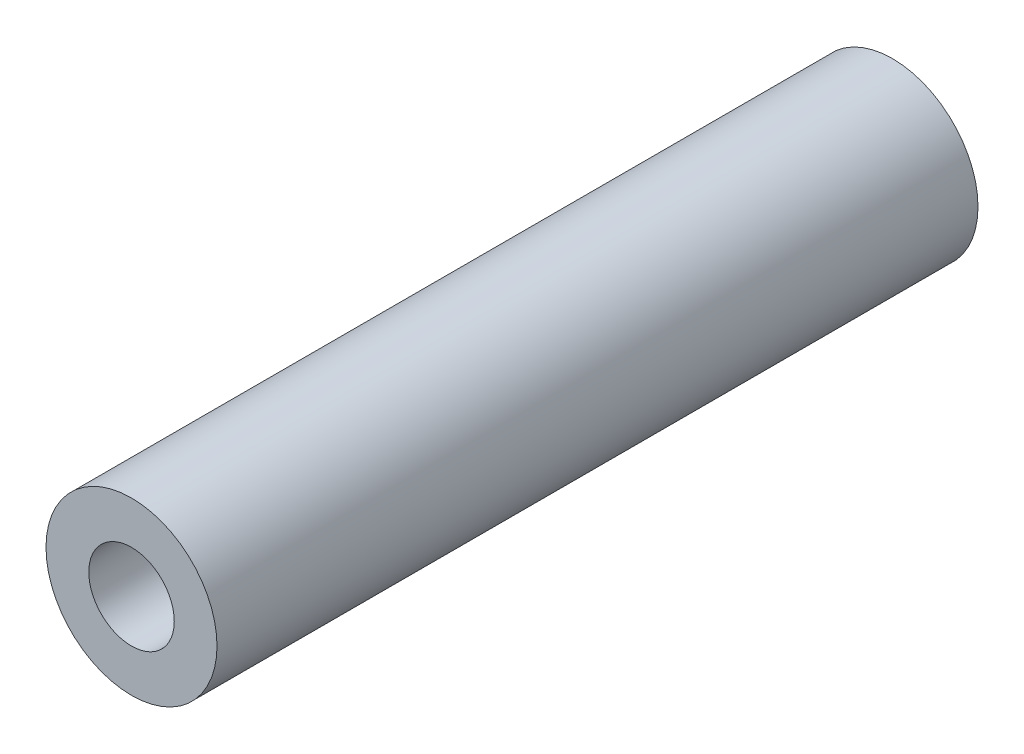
ISO-10303-21;
HEADER;
FILE_DESCRIPTION(('STEP AP214'),'2;1');
FILE_NAME('part.step','',(''),(''),'','','');
FILE_SCHEMA(('AUTOMOTIVE_DESIGN { 1 0 10303 214 1 1 1 1 }'));
ENDSEC;
DATA;
#1=APPLICATION_CONTEXT('core data for automotive mechanical design processes');
#2=APPLICATION_PROTOCOL_DEFINITION('international standard','automotive_design',2000,#1);
#3=PRODUCT_CONTEXT('',#1,'mechanical');
#4=PRODUCT('Part','Part','',(#3));
#5=PRODUCT_RELATED_PRODUCT_CATEGORY('part','',(#4));
#6=PRODUCT_DEFINITION_FORMATION('','',#4);
#7=PRODUCT_DEFINITION_CONTEXT('part definition',#1,'design');
#8=PRODUCT_DEFINITION('design','',#6,#7);
#9=PRODUCT_DEFINITION_SHAPE('','',#8);
#10=(LENGTH_UNIT() NAMED_UNIT(*) SI_UNIT(.MILLI.,.METRE.));
#11=(NAMED_UNIT(*) PLANE_ANGLE_UNIT() SI_UNIT($,.RADIAN.));
#12=(NAMED_UNIT(*) SI_UNIT($,.STERADIAN.) SOLID_ANGLE_UNIT());
#13=UNCERTAINTY_MEASURE_WITH_UNIT(LENGTH_MEASURE(1.E-05),#10,'distance_accuracy_value','');
#14=(GEOMETRIC_REPRESENTATION_CONTEXT(3) GLOBAL_UNCERTAINTY_ASSIGNED_CONTEXT((#13)) GLOBAL_UNIT_ASSIGNED_CONTEXT((#10,
#11,#12)) REPRESENTATION_CONTEXT('',''));
#15=CARTESIAN_POINT('',(0.,0.,0.));
#16=DIRECTION('',(0.,0.,1.));
#17=DIRECTION('',(1.,0.,0.));
#18=AXIS2_PLACEMENT_3D('',#15,#16,#17);
#19=CARTESIAN_POINT('',(0.,0.,89.));
#20=DIRECTION('',(0.,0.,1.));
#21=DIRECTION('',(1.,0.,0.));
#22=AXIS2_PLACEMENT_3D('',#19,#20,#21);
#23=PLANE('',#22);
#24=CARTESIAN_POINT('',(0.,0.,89.));
#25=DIRECTION('',(0.,0.,1.));
#26=DIRECTION('',(1.,0.,0.));
#27=AXIS2_PLACEMENT_3D('',#24,#25,#26);
#28=CIRCLE('',#27,10.);
#29=CARTESIAN_POINT('',(10.,0.,89.));
#30=VERTEX_POINT('',#29);
#31=EDGE_CURVE('E9',#30,#30,#28,.T.);
#32=ORIENTED_EDGE('',*,*,#31,.T.);
#33=EDGE_LOOP('',(#32));
#34=FACE_BOUND('',#33,.T.);
#35=CARTESIAN_POINT('',(0.,0.,89.));
#36=DIRECTION('',(0.,0.,1.));
#37=DIRECTION('',(1.,0.,0.));
#38=AXIS2_PLACEMENT_3D('',#35,#36,#37);
#39=CIRCLE('',#38,5.);
#40=CARTESIAN_POINT('',(5.,0.,89.));
#41=VERTEX_POINT('',#40);
#42=EDGE_CURVE('E25',#41,#41,#39,.T.);
#43=ORIENTED_EDGE('',*,*,#42,.F.);
#44=EDGE_LOOP('',(#43));
#45=FACE_BOUND('',#44,.T.);
#46=ADVANCED_FACE('F14',(#34,#45),#23,.T.);
#47=CARTESIAN_POINT('',(0.,0.,0.));
#48=DIRECTION('',(0.,0.,1.));
#49=DIRECTION('',(1.,0.,0.));
#50=AXIS2_PLACEMENT_3D('',#47,#48,#49);
#51=PLANE('',#50);
#52=CARTESIAN_POINT('',(0.,0.,0.));
#53=DIRECTION('',(0.,0.,1.));
#54=DIRECTION('',(1.,0.,0.));
#55=AXIS2_PLACEMENT_3D('',#52,#53,#54);
#56=CIRCLE('',#55,10.);
#57=CARTESIAN_POINT('',(10.,0.,0.));
#58=VERTEX_POINT('',#57);
#59=EDGE_CURVE('E18',#58,#58,#56,.T.);
#60=ORIENTED_EDGE('',*,*,#59,.F.);
#61=EDGE_LOOP('',(#60));
#62=FACE_BOUND('',#61,.T.);
#63=CARTESIAN_POINT('',(0.,0.,0.));
#64=DIRECTION('',(0.,0.,1.));
#65=DIRECTION('',(1.,0.,0.));
#66=AXIS2_PLACEMENT_3D('',#63,#64,#65);
#67=CIRCLE('',#66,5.);
#68=CARTESIAN_POINT('',(5.,0.,0.));
#69=VERTEX_POINT('',#68);
#70=EDGE_CURVE('E27',#69,#69,#67,.T.);
#71=ORIENTED_EDGE('',*,*,#70,.T.);
#72=EDGE_LOOP('',(#71));
#73=FACE_BOUND('',#72,.T.);
#74=ADVANCED_FACE('F37',(#62,#73),#51,.F.);
#75=CARTESIAN_POINT('',(0.,0.,89.));
#76=DIRECTION('',(0.,0.,-1.));
#77=DIRECTION('',(-1.,0.,0.));
#78=AXIS2_PLACEMENT_3D('',#75,#76,#77);
#79=CYLINDRICAL_SURFACE('',#78,10.);
#80=ORIENTED_EDGE('',*,*,#31,.F.);
#81=EDGE_LOOP('',(#80));
#82=FACE_BOUND('',#81,.T.);
#83=ORIENTED_EDGE('',*,*,#59,.T.);
#84=EDGE_LOOP('',(#83));
#85=FACE_BOUND('',#84,.T.);
#86=ADVANCED_FACE('F16',(#82,#85),#79,.T.);
#87=CARTESIAN_POINT('',(0.,0.,89.));
#88=DIRECTION('',(0.,0.,-1.));
#89=DIRECTION('',(-1.,0.,0.));
#90=AXIS2_PLACEMENT_3D('',#87,#88,#89);
#91=CYLINDRICAL_SURFACE('',#90,5.);
#92=ORIENTED_EDGE('',*,*,#42,.T.);
#93=EDGE_LOOP('',(#92));
#94=FACE_BOUND('',#93,.T.);
#95=ORIENTED_EDGE('',*,*,#70,.F.);
#96=EDGE_LOOP('',(#95));
#97=FACE_BOUND('',#96,.T.);
#98=ADVANCED_FACE('F33',(#94,#97),#91,.F.);
#99=CLOSED_SHELL('',(#46,#74,#86,#98));
#100=MANIFOLD_SOLID_BREP('B1',#99);
#101=ADVANCED_BREP_SHAPE_REPRESENTATION('',(#18,#100),#14);
#102=SHAPE_DEFINITION_REPRESENTATION(#9,#101);
ENDSEC;
END-ISO-10303-21;
